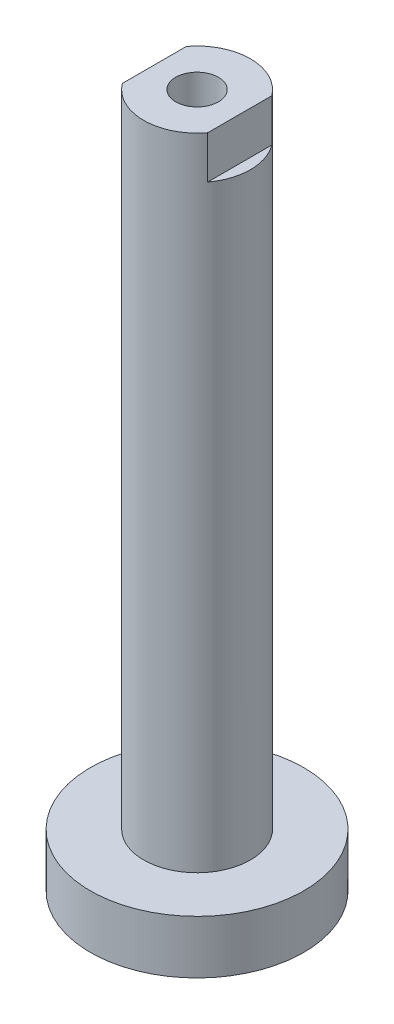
ISO-10303-21;
HEADER;
FILE_DESCRIPTION(('STEP AP214'),'2;1');
FILE_NAME('part.step','',(''),(''),'','','');
FILE_SCHEMA(('AUTOMOTIVE_DESIGN { 1 0 10303 214 1 1 1 1 }'));
ENDSEC;
DATA;
#1=APPLICATION_CONTEXT('core data for automotive mechanical design processes');
#2=APPLICATION_PROTOCOL_DEFINITION('international standard','automotive_design',2000,#1);
#3=PRODUCT_CONTEXT('',#1,'mechanical');
#4=PRODUCT('Part','Part','',(#3));
#5=PRODUCT_RELATED_PRODUCT_CATEGORY('part','',(#4));
#6=PRODUCT_DEFINITION_FORMATION('','',#4);
#7=PRODUCT_DEFINITION_CONTEXT('part definition',#1,'design');
#8=PRODUCT_DEFINITION('design','',#6,#7);
#9=PRODUCT_DEFINITION_SHAPE('','',#8);
#10=(LENGTH_UNIT() NAMED_UNIT(*) SI_UNIT(.MILLI.,.METRE.));
#11=(NAMED_UNIT(*) PLANE_ANGLE_UNIT() SI_UNIT($,.RADIAN.));
#12=(NAMED_UNIT(*) SI_UNIT($,.STERADIAN.) SOLID_ANGLE_UNIT());
#13=UNCERTAINTY_MEASURE_WITH_UNIT(LENGTH_MEASURE(1.E-05),#10,'distance_accuracy_value','');
#14=(GEOMETRIC_REPRESENTATION_CONTEXT(3) GLOBAL_UNCERTAINTY_ASSIGNED_CONTEXT((#13)) GLOBAL_UNIT_ASSIGNED_CONTEXT((#10,
#11,#12)) REPRESENTATION_CONTEXT('',''));
#15=CARTESIAN_POINT('',(0.,0.,0.));
#16=DIRECTION('',(0.,0.,1.));
#17=DIRECTION('',(1.,0.,0.));
#18=AXIS2_PLACEMENT_3D('',#15,#16,#17);
#19=CARTESIAN_POINT('',(0.,60.,-1.99999999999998));
#20=DIRECTION('',(0.,1.,0.));
#21=DIRECTION('',(0.,0.,1.));
#22=AXIS2_PLACEMENT_3D('',#19,#20,#21);
#23=PLANE('',#22);
#24=CARTESIAN_POINT('',(0.,60.,0.));
#25=DIRECTION('',(0.,-1.,0.));
#26=DIRECTION('',(0.,0.,-1.));
#27=AXIS2_PLACEMENT_3D('',#24,#25,#26);
#28=CIRCLE('',#27,2.);
#29=CARTESIAN_POINT('',(0.,60.,-1.99999999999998));
#30=VERTEX_POINT('',#29);
#31=EDGE_CURVE('E106',#30,#30,#28,.T.);
#32=ORIENTED_EDGE('',*,*,#31,.T.);
#33=EDGE_LOOP('',(#32));
#34=FACE_BOUND('',#33,.T.);
#35=CARTESIAN_POINT('',(0.,60.,0.));
#36=DIRECTION('',(0.,-1.,0.));
#37=DIRECTION('',(0.,0.,-1.));
#38=AXIS2_PLACEMENT_3D('',#35,#36,#37);
#39=CIRCLE('',#38,5.00000000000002);
#40=CARTESIAN_POINT('',(-4.,60.,-2.99999999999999));
#41=VERTEX_POINT('',#40);
#42=CARTESIAN_POINT('',(4.,60.,-3.));
#43=VERTEX_POINT('',#42);
#44=EDGE_CURVE('E107',#41,#43,#39,.T.);
#45=ORIENTED_EDGE('',*,*,#44,.F.);
#46=DIRECTION('',(0.,0.,1.));
#47=VECTOR('',#46,1.);
#48=CARTESIAN_POINT('',(-4.,60.,-5.80331358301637));
#49=LINE('',#48,#47);
#50=CARTESIAN_POINT('',(-4.,60.,3.00000000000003));
#51=VERTEX_POINT('',#50);
#52=EDGE_CURVE('E93',#41,#51,#49,.T.);
#53=ORIENTED_EDGE('',*,*,#52,.T.);
#54=CARTESIAN_POINT('',(4.,60.,3.00000000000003));
#55=VERTEX_POINT('',#54);
#56=EDGE_CURVE('E101',#55,#51,#39,.T.);
#57=ORIENTED_EDGE('',*,*,#56,.F.);
#58=DIRECTION('',(0.,0.,-1.));
#59=VECTOR('',#58,1.);
#60=CARTESIAN_POINT('',(4.,60.,-5.80331358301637));
#61=LINE('',#60,#59);
#62=EDGE_CURVE('E83',#55,#43,#61,.T.);
#63=ORIENTED_EDGE('',*,*,#62,.T.);
#64=EDGE_LOOP('',(#45,#53,#57,#63));
#65=FACE_BOUND('',#64,.T.);
#66=ADVANCED_FACE('F44',(#34,#65),#23,.T.);
#67=CARTESIAN_POINT('',(0.,0.,0.));
#68=DIRECTION('',(0.,-1.,0.));
#69=DIRECTION('',(0.,0.,-1.));
#70=AXIS2_PLACEMENT_3D('',#67,#68,#69);
#71=CYLINDRICAL_SURFACE('',#70,5.00000000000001);
#72=CARTESIAN_POINT('',(0.,0.,0.));
#73=DIRECTION('',(0.,-1.,0.));
#74=DIRECTION('',(0.,0.,-1.));
#75=AXIS2_PLACEMENT_3D('',#72,#73,#74);
#76=CIRCLE('',#75,5.);
#77=CARTESIAN_POINT('',(0.,0.,-5.));
#78=VERTEX_POINT('',#77);
#79=EDGE_CURVE('E112',#78,#78,#76,.T.);
#80=ORIENTED_EDGE('',*,*,#79,.F.);
#81=EDGE_LOOP('',(#80));
#82=FACE_BOUND('',#81,.T.);
#83=CARTESIAN_POINT('',(0.,56.,0.));
#84=DIRECTION('',(0.,1.,0.));
#85=DIRECTION('',(0.,0.,1.));
#86=AXIS2_PLACEMENT_3D('',#83,#84,#85);
#87=CIRCLE('',#86,5.00000000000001);
#88=CARTESIAN_POINT('',(-4.,56.,3.00000000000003));
#89=VERTEX_POINT('',#88);
#90=CARTESIAN_POINT('',(-4.,56.,-2.99999999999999));
#91=VERTEX_POINT('',#90);
#92=EDGE_CURVE('E52',#89,#91,#87,.F.);
#93=ORIENTED_EDGE('',*,*,#92,.T.);
#94=DIRECTION('',(0.,-1.,0.));
#95=VECTOR('',#94,1.);
#96=CARTESIAN_POINT('',(-4.,0.,-3.00000000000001));
#97=LINE('',#96,#95);
#98=EDGE_CURVE('E12',#91,#41,#97,.F.);
#99=ORIENTED_EDGE('',*,*,#98,.T.);
#100=ORIENTED_EDGE('',*,*,#44,.T.);
#101=DIRECTION('',(0.,-1.,0.));
#102=VECTOR('',#101,1.);
#103=CARTESIAN_POINT('',(4.,0.,-3.00000000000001));
#104=LINE('',#103,#102);
#105=CARTESIAN_POINT('',(4.,56.,-3.));
#106=VERTEX_POINT('',#105);
#107=EDGE_CURVE('E88',#43,#106,#104,.T.);
#108=ORIENTED_EDGE('',*,*,#107,.T.);
#109=CARTESIAN_POINT('',(4.,56.,3.00000000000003));
#110=VERTEX_POINT('',#109);
#111=EDGE_CURVE('E102',#106,#110,#87,.F.);
#112=ORIENTED_EDGE('',*,*,#111,.T.);
#113=DIRECTION('',(0.,-1.,0.));
#114=VECTOR('',#113,1.);
#115=CARTESIAN_POINT('',(4.,0.,3.00000000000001));
#116=LINE('',#115,#114);
#117=EDGE_CURVE('E86',#110,#55,#116,.F.);
#118=ORIENTED_EDGE('',*,*,#117,.T.);
#119=ORIENTED_EDGE('',*,*,#56,.T.);
#120=DIRECTION('',(0.,-1.,0.));
#121=VECTOR('',#120,1.);
#122=CARTESIAN_POINT('',(-4.,0.,3.00000000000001));
#123=LINE('',#122,#121);
#124=EDGE_CURVE('E103',#51,#89,#123,.T.);
#125=ORIENTED_EDGE('',*,*,#124,.T.);
#126=EDGE_LOOP('',(#93,#99,#100,#108,#112,#118,#119,#125));
#127=FACE_BOUND('',#126,.T.);
#128=ADVANCED_FACE('F99',(#82,#127),#71,.T.);
#129=CARTESIAN_POINT('',(0.,-5.,-10.));
#130=DIRECTION('',(0.,-1.,0.));
#131=DIRECTION('',(0.,0.,-1.));
#132=AXIS2_PLACEMENT_3D('',#129,#130,#131);
#133=PLANE('',#132);
#134=CARTESIAN_POINT('',(0.,-5.,0.));
#135=DIRECTION('',(0.,-1.,0.));
#136=DIRECTION('',(0.,0.,-1.));
#137=AXIS2_PLACEMENT_3D('',#134,#135,#136);
#138=CIRCLE('',#137,10.);
#139=CARTESIAN_POINT('',(0.,-5.,-10.));
#140=VERTEX_POINT('',#139);
#141=EDGE_CURVE('E122',#140,#140,#138,.T.);
#142=ORIENTED_EDGE('',*,*,#141,.T.);
#143=EDGE_LOOP('',(#142));
#144=FACE_BOUND('',#143,.T.);
#145=ADVANCED_FACE('F46',(#144),#133,.T.);
#146=CARTESIAN_POINT('',(0.,50.,0.));
#147=DIRECTION('',(0.,1.,0.));
#148=DIRECTION('',(0.,0.,1.));
#149=AXIS2_PLACEMENT_3D('',#146,#147,#148);
#150=PLANE('',#149);
#151=CARTESIAN_POINT('',(0.,50.,0.));
#152=DIRECTION('',(0.,-1.,0.));
#153=DIRECTION('',(0.,0.,-1.));
#154=AXIS2_PLACEMENT_3D('',#151,#152,#153);
#155=CIRCLE('',#154,2.);
#156=CARTESIAN_POINT('',(0.,50.,-1.99999999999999));
#157=VERTEX_POINT('',#156);
#158=EDGE_CURVE('E110',#157,#157,#155,.T.);
#159=ORIENTED_EDGE('',*,*,#158,.F.);
#160=EDGE_LOOP('',(#159));
#161=FACE_BOUND('',#160,.T.);
#162=ADVANCED_FACE('F144',(#161),#150,.T.);
#163=CARTESIAN_POINT('',(0.,0.,0.));
#164=DIRECTION('',(0.,-1.,0.));
#165=DIRECTION('',(0.,0.,-1.));
#166=AXIS2_PLACEMENT_3D('',#163,#164,#165);
#167=CYLINDRICAL_SURFACE('',#166,2.);
#168=ORIENTED_EDGE('',*,*,#158,.T.);
#169=EDGE_LOOP('',(#168));
#170=FACE_BOUND('',#169,.T.);
#171=ORIENTED_EDGE('',*,*,#31,.F.);
#172=EDGE_LOOP('',(#171));
#173=FACE_BOUND('',#172,.T.);
#174=ADVANCED_FACE('F151',(#170,#173),#167,.F.);
#175=CARTESIAN_POINT('',(0.,0.,-5.));
#176=DIRECTION('',(0.,1.,0.));
#177=DIRECTION('',(0.,0.,1.));
#178=AXIS2_PLACEMENT_3D('',#175,#176,#177);
#179=PLANE('',#178);
#180=ORIENTED_EDGE('',*,*,#79,.T.);
#181=EDGE_LOOP('',(#180));
#182=FACE_BOUND('',#181,.T.);
#183=CARTESIAN_POINT('',(0.,0.,0.));
#184=DIRECTION('',(0.,-1.,0.));
#185=DIRECTION('',(0.,0.,-1.));
#186=AXIS2_PLACEMENT_3D('',#183,#184,#185);
#187=CIRCLE('',#186,10.);
#188=CARTESIAN_POINT('',(0.,0.,-10.));
#189=VERTEX_POINT('',#188);
#190=EDGE_CURVE('E127',#189,#189,#187,.T.);
#191=ORIENTED_EDGE('',*,*,#190,.F.);
#192=EDGE_LOOP('',(#191));
#193=FACE_BOUND('',#192,.T.);
#194=ADVANCED_FACE('F134',(#182,#193),#179,.T.);
#195=CARTESIAN_POINT('',(0.,0.,0.));
#196=DIRECTION('',(0.,-1.,0.));
#197=DIRECTION('',(0.,0.,-1.));
#198=AXIS2_PLACEMENT_3D('',#195,#196,#197);
#199=CYLINDRICAL_SURFACE('',#198,10.);
#200=ORIENTED_EDGE('',*,*,#190,.T.);
#201=EDGE_LOOP('',(#200));
#202=FACE_BOUND('',#201,.T.);
#203=ORIENTED_EDGE('',*,*,#141,.F.);
#204=EDGE_LOOP('',(#203));
#205=FACE_BOUND('',#204,.T.);
#206=ADVANCED_FACE('F177',(#202,#205),#199,.T.);
#207=CARTESIAN_POINT('',(4.,56.,-5.80331358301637));
#208=DIRECTION('',(1.,0.,0.));
#209=DIRECTION('',(0.,0.,-1.));
#210=AXIS2_PLACEMENT_3D('',#207,#208,#209);
#211=PLANE('',#210);
#212=DIRECTION('',(0.,0.,-1.));
#213=VECTOR('',#212,1.);
#214=CARTESIAN_POINT('',(4.,56.,-5.80331358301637));
#215=LINE('',#214,#213);
#216=EDGE_CURVE('E67',#110,#106,#215,.T.);
#217=ORIENTED_EDGE('',*,*,#216,.T.);
#218=ORIENTED_EDGE('',*,*,#107,.F.);
#219=ORIENTED_EDGE('',*,*,#62,.F.);
#220=ORIENTED_EDGE('',*,*,#117,.F.);
#221=EDGE_LOOP('',(#217,#218,#219,#220));
#222=FACE_BOUND('',#221,.T.);
#223=ADVANCED_FACE('F85',(#222),#211,.T.);
#224=CARTESIAN_POINT('',(0.,56.,0.));
#225=DIRECTION('',(0.,1.,0.));
#226=DIRECTION('',(0.,0.,1.));
#227=AXIS2_PLACEMENT_3D('',#224,#225,#226);
#228=PLANE('',#227);
#229=ORIENTED_EDGE('',*,*,#216,.F.);
#230=ORIENTED_EDGE('',*,*,#111,.F.);
#231=EDGE_LOOP('',(#229,#230));
#232=FACE_BOUND('',#231,.T.);
#233=ADVANCED_FACE('F194',(#232),#228,.T.);
#234=DIRECTION('',(0.,0.,1.));
#235=VECTOR('',#234,1.);
#236=CARTESIAN_POINT('',(-4.,56.,-5.80331358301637));
#237=LINE('',#236,#235);
#238=EDGE_CURVE('E59',#91,#89,#237,.T.);
#239=ORIENTED_EDGE('',*,*,#238,.F.);
#240=ORIENTED_EDGE('',*,*,#92,.F.);
#241=EDGE_LOOP('',(#239,#240));
#242=FACE_BOUND('',#241,.T.);
#243=ADVANCED_FACE('F120',(#242),#228,.T.);
#244=CARTESIAN_POINT('',(-4.,56.,-5.80331358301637));
#245=DIRECTION('',(-1.,0.,0.));
#246=DIRECTION('',(0.,0.,1.));
#247=AXIS2_PLACEMENT_3D('',#244,#245,#246);
#248=PLANE('',#247);
#249=ORIENTED_EDGE('',*,*,#238,.T.);
#250=ORIENTED_EDGE('',*,*,#124,.F.);
#251=ORIENTED_EDGE('',*,*,#52,.F.);
#252=ORIENTED_EDGE('',*,*,#98,.F.);
#253=EDGE_LOOP('',(#249,#250,#251,#252));
#254=FACE_BOUND('',#253,.T.);
#255=ADVANCED_FACE('F208',(#254),#248,.T.);
#256=CLOSED_SHELL('',(#66,#128,#145,#162,#174,#194,#206,#223,#233,#243,#255));
#257=MANIFOLD_SOLID_BREP('B2',#256);
#258=ADVANCED_BREP_SHAPE_REPRESENTATION('',(#18,#257),#14);
#259=SHAPE_DEFINITION_REPRESENTATION(#9,#258);
ENDSEC;
END-ISO-10303-21;
